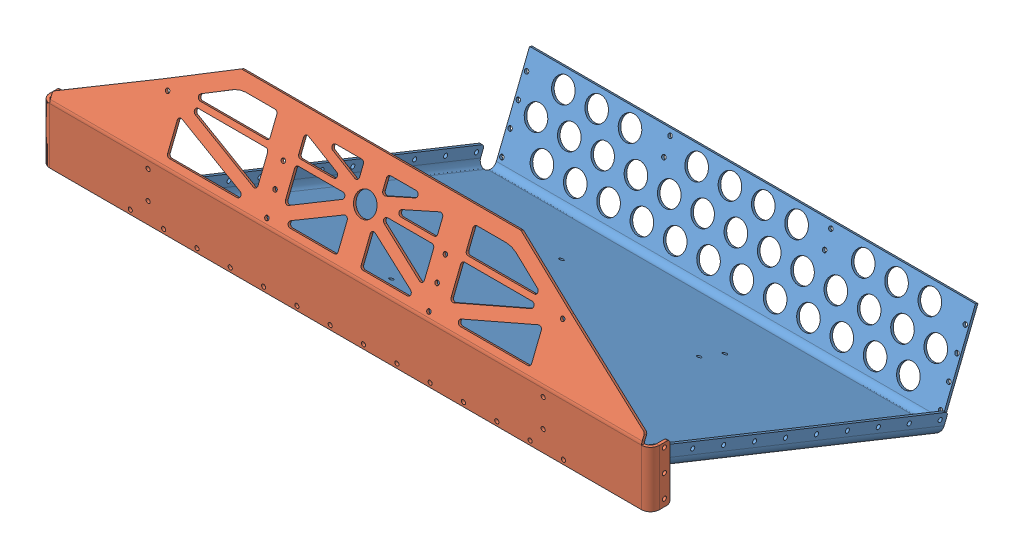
SolidWorks assembly 2_Bellyassembly.SLDASM, configuration Default (file format 7000). Lengths in mm.
Overall size (697.23 343.17 470.92).
3 component instances, 3 part files, 6 mates.
Components (placement in the parent):
- 2_Bellypan-1: 2_Bellypan.SLDPRT [Default] at (-104.5867 349.3554 737.5562) (suppressed, hidden)
- 2_Bellypanpart1-1: 2_Bellypanpart1.SLDPRT [Default] at (-104.5867 372.5426 736.9786) x (1 0 0) z (0 0.371391 0.928477) size (533.4 112.37 462.25)
- 2_Bellypanpart2-1: 2_Bellypanpart2.SLDPRT [Default] at (-104.5867 349.3554 737.5562) size (697.23 167.25 43.52)
Mates (geometry in assembly coordinates):
- Coincident1: coincident aligned: plane of 2_Bellypan-1 through (-104.5867 184.4365 325.259) normal (0 0.371391 0.928477); plane of 2_Bellypanpart1-1 through (-104.5867 184.4365 325.259) normal (0 0.371391 0.928477)
- Coincident2: coincident aligned: plane of 2_Bellypan-1 through (-104.5867 372.4914 728.3018) normal (0 0.928477 -0.371391); plane of 2_Bellypanpart1-1 through (-104.5867 372.4914 728.3018) normal (0 0.928477 -0.371391)
- Coincident3: coincident aligned: plane of 2_Bellypan-1 through (398.9683 349.3554 737.5562) normal (1 0 0); plane of 2_Bellypanpart1-1 through (398.9683 349.3554 737.5562) normal (1 0 0)
- Coincident4: coincident aligned: plane of 2_Bellypan-1 through (480.8833 349.3554 737.5562) normal (1 0 0); plane of 2_Bellypanpart2-1 through (480.8833 349.3554 737.5562) normal (1 0 0)
- Coincident5: coincident aligned: plane of 2_Bellypan-1 through (-104.5867 363.6696 773.3418) normal (0 0.371391 0.928477); plane of 2_Bellypanpart2-1 through (-104.5867 363.6696 773.3418) normal (0 0.371391 0.928477)
- Coincident6: coincident aligned: plane of 2_Bellypan-1 through (-104.5867 349.3554 737.5562) normal (0 0 -1); plane of 2_Bellypanpart2-1 through (-104.5867 349.3554 737.5562) normal (0 0 -1)
